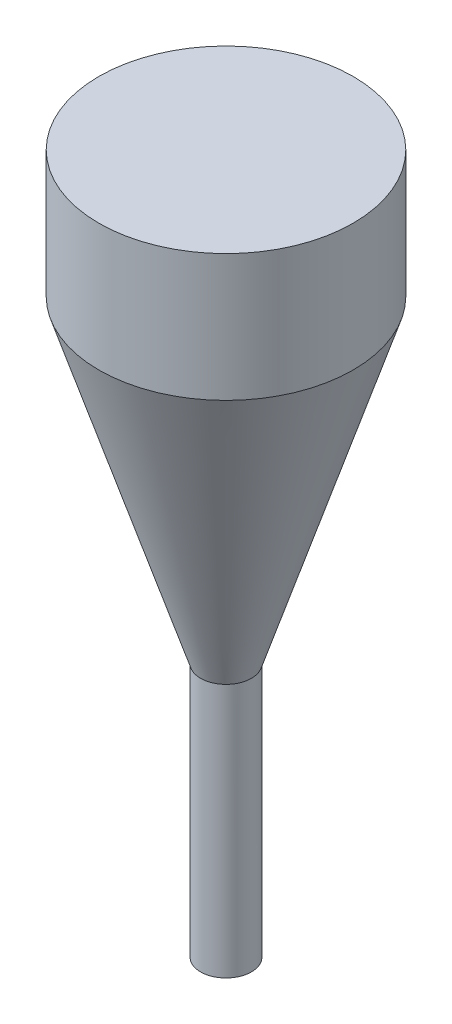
from build123d import *

# Parameters (mm, degrees)
SKETCH2_R           = 2
BOSS_EXTRUDE1_DEPTH = 20


with BuildPart() as part:
    # Sketch1 → Revolve1 (revolve)
    with BuildSketch(Plane.XY, mode=Mode.PRIVATE) as revolve1_sk:
        Polygon((0, 0), (0, 35), (10, 35), (10, 25), (2, 0), align=None)
    revolve(revolve1_sk.sketch.rotate(Axis((0, 0, 0), (0, 1, 0)), 90), axis=Axis((0, 0, 0), (0, 1, 0)))

    # Sketch2 → Boss-Extrude1 (add)
    with BuildSketch(Plane.XZ):
        with Locations(Location((0, 0, 0), (0, 0, 90))):
            Circle(SKETCH2_R)
    extrude(amount=BOSS_EXTRUDE1_DEPTH)


solid = part.part
